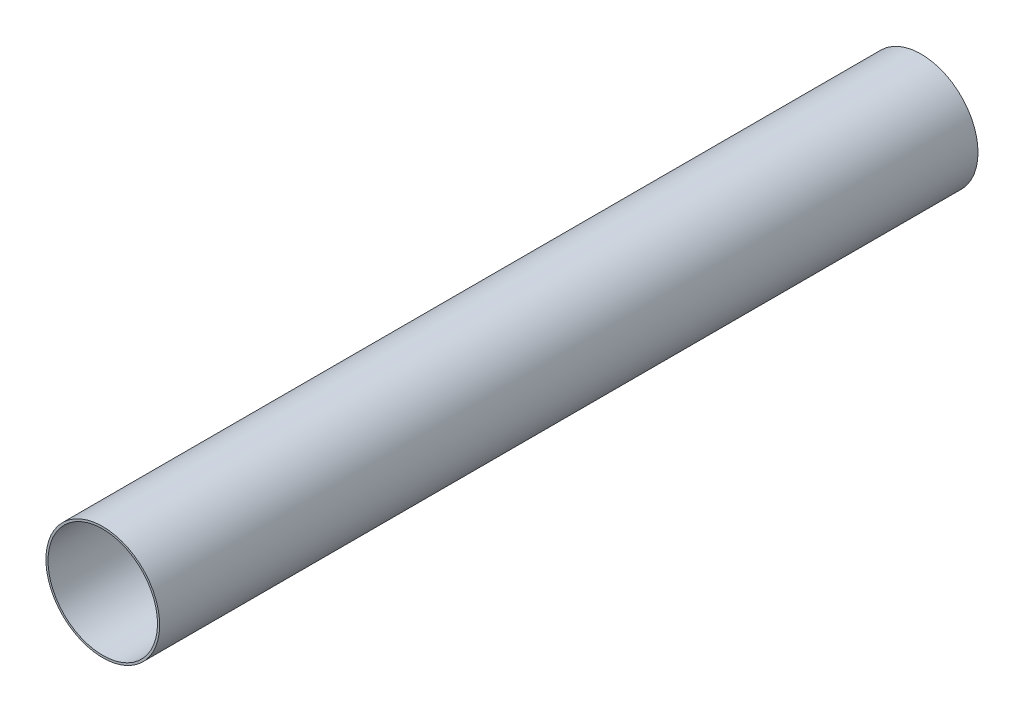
from build123d import *

# Parameters (mm, degrees)
SKIZZE1_R                    = 69.5
SKIZZE1_R_2                  = 66.9
LINEAR_AUSTRAGEN_D_NN1_DEPTH = 500


with BuildPart() as part:
    # Skizze1 → Linear-Austragen-D_nn1 (new, symmetric)
    with BuildSketch(Plane.XY):
        Circle(SKIZZE1_R)
        Circle(SKIZZE1_R_2, mode=Mode.SUBTRACT)
    extrude(amount=LINEAR_AUSTRAGEN_D_NN1_DEPTH, both=True)


solid = part.part
